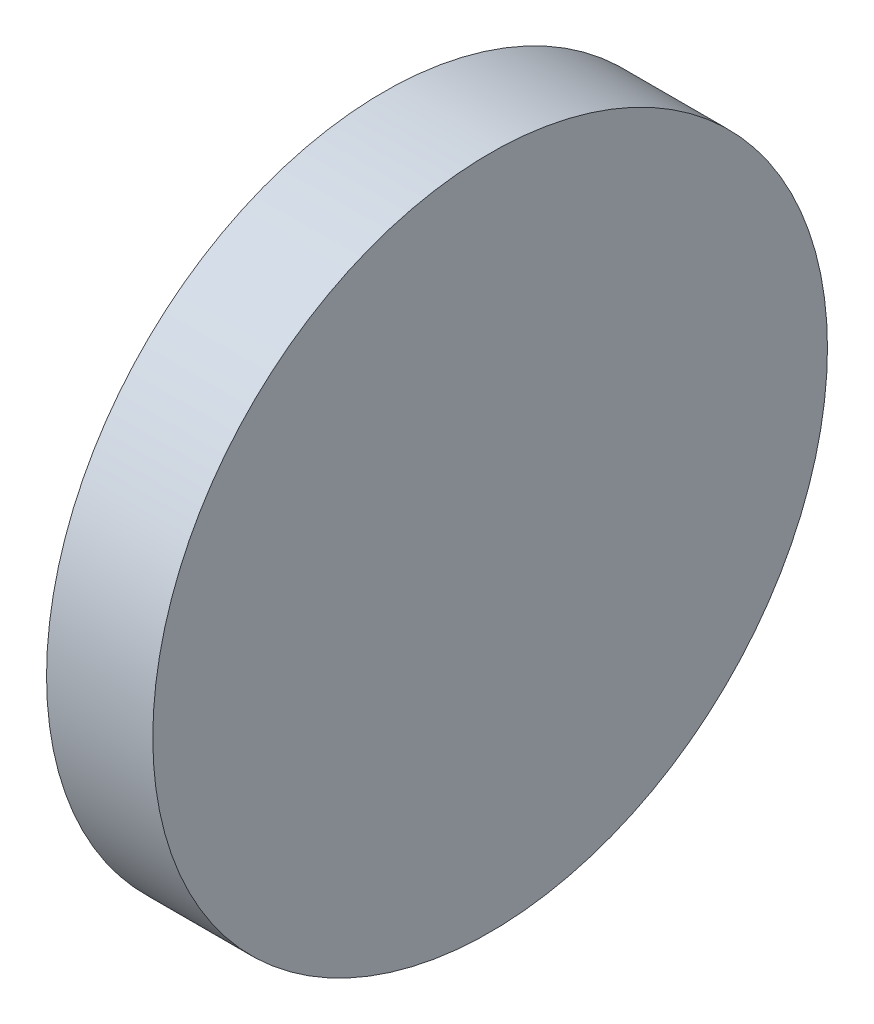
ISO-10303-21;
HEADER;
FILE_DESCRIPTION(('STEP AP214'),'2;1');
FILE_NAME('part.step','',(''),(''),'','','');
FILE_SCHEMA(('AUTOMOTIVE_DESIGN { 1 0 10303 214 1 1 1 1 }'));
ENDSEC;
DATA;
#1=APPLICATION_CONTEXT('core data for automotive mechanical design processes');
#2=APPLICATION_PROTOCOL_DEFINITION('international standard','automotive_design',2000,#1);
#3=PRODUCT_CONTEXT('',#1,'mechanical');
#4=PRODUCT('Part','Part','',(#3));
#5=PRODUCT_RELATED_PRODUCT_CATEGORY('part','',(#4));
#6=PRODUCT_DEFINITION_FORMATION('','',#4);
#7=PRODUCT_DEFINITION_CONTEXT('part definition',#1,'design');
#8=PRODUCT_DEFINITION('design','',#6,#7);
#9=PRODUCT_DEFINITION_SHAPE('','',#8);
#10=(LENGTH_UNIT() NAMED_UNIT(*) SI_UNIT(.MILLI.,.METRE.));
#11=(NAMED_UNIT(*) PLANE_ANGLE_UNIT() SI_UNIT($,.RADIAN.));
#12=(NAMED_UNIT(*) SI_UNIT($,.STERADIAN.) SOLID_ANGLE_UNIT());
#13=UNCERTAINTY_MEASURE_WITH_UNIT(LENGTH_MEASURE(1.E-05),#10,'distance_accuracy_value','');
#14=(GEOMETRIC_REPRESENTATION_CONTEXT(3) GLOBAL_UNCERTAINTY_ASSIGNED_CONTEXT((#13)) GLOBAL_UNIT_ASSIGNED_CONTEXT((#10,
#11,#12)) REPRESENTATION_CONTEXT('',''));
#15=CARTESIAN_POINT('',(0.,0.,0.));
#16=DIRECTION('',(0.,0.,1.));
#17=DIRECTION('',(1.,0.,0.));
#18=AXIS2_PLACEMENT_3D('',#15,#16,#17);
#19=CARTESIAN_POINT('',(5.,0.,0.));
#20=DIRECTION('',(-1.,0.,0.));
#21=DIRECTION('',(0.,0.,1.));
#22=AXIS2_PLACEMENT_3D('',#19,#20,#21);
#23=CYLINDRICAL_SURFACE('',#22,31.75);
#24=CARTESIAN_POINT('',(5.,0.,0.));
#25=DIRECTION('',(1.,0.,0.));
#26=DIRECTION('',(0.,0.,-1.));
#27=AXIS2_PLACEMENT_3D('',#24,#25,#26);
#28=CIRCLE('',#27,31.75);
#29=CARTESIAN_POINT('',(5.,0.,-31.75));
#30=VERTEX_POINT('',#29);
#31=EDGE_CURVE('E10',#30,#30,#28,.T.);
#32=ORIENTED_EDGE('',*,*,#31,.F.);
#33=EDGE_LOOP('',(#32));
#34=FACE_BOUND('',#33,.T.);
#35=CARTESIAN_POINT('',(-5.,0.,0.));
#36=DIRECTION('',(1.,0.,0.));
#37=DIRECTION('',(0.,0.,-1.));
#38=AXIS2_PLACEMENT_3D('',#35,#36,#37);
#39=CIRCLE('',#38,31.75);
#40=CARTESIAN_POINT('',(-5.,0.,-31.75));
#41=VERTEX_POINT('',#40);
#42=EDGE_CURVE('E33',#41,#41,#39,.T.);
#43=ORIENTED_EDGE('',*,*,#42,.T.);
#44=EDGE_LOOP('',(#43));
#45=FACE_BOUND('',#44,.T.);
#46=ADVANCED_FACE('F30',(#34,#45),#23,.T.);
#47=CARTESIAN_POINT('',(5.,0.,0.));
#48=DIRECTION('',(1.,0.,0.));
#49=DIRECTION('',(0.,0.,-1.));
#50=AXIS2_PLACEMENT_3D('',#47,#48,#49);
#51=PLANE('',#50);
#52=ORIENTED_EDGE('',*,*,#31,.T.);
#53=EDGE_LOOP('',(#52));
#54=FACE_BOUND('',#53,.T.);
#55=ADVANCED_FACE('F45',(#54),#51,.T.);
#56=CARTESIAN_POINT('',(-5.,0.,0.));
#57=DIRECTION('',(1.,0.,0.));
#58=DIRECTION('',(0.,0.,-1.));
#59=AXIS2_PLACEMENT_3D('',#56,#57,#58);
#60=PLANE('',#59);
#61=ORIENTED_EDGE('',*,*,#42,.F.);
#62=EDGE_LOOP('',(#61));
#63=FACE_BOUND('',#62,.T.);
#64=ADVANCED_FACE('F43',(#63),#60,.F.);
#65=CLOSED_SHELL('',(#46,#55,#64));
#66=MANIFOLD_SOLID_BREP('B2',#65);
#67=ADVANCED_BREP_SHAPE_REPRESENTATION('',(#18,#66),#14);
#68=SHAPE_DEFINITION_REPRESENTATION(#9,#67);
ENDSEC;
END-ISO-10303-21;
